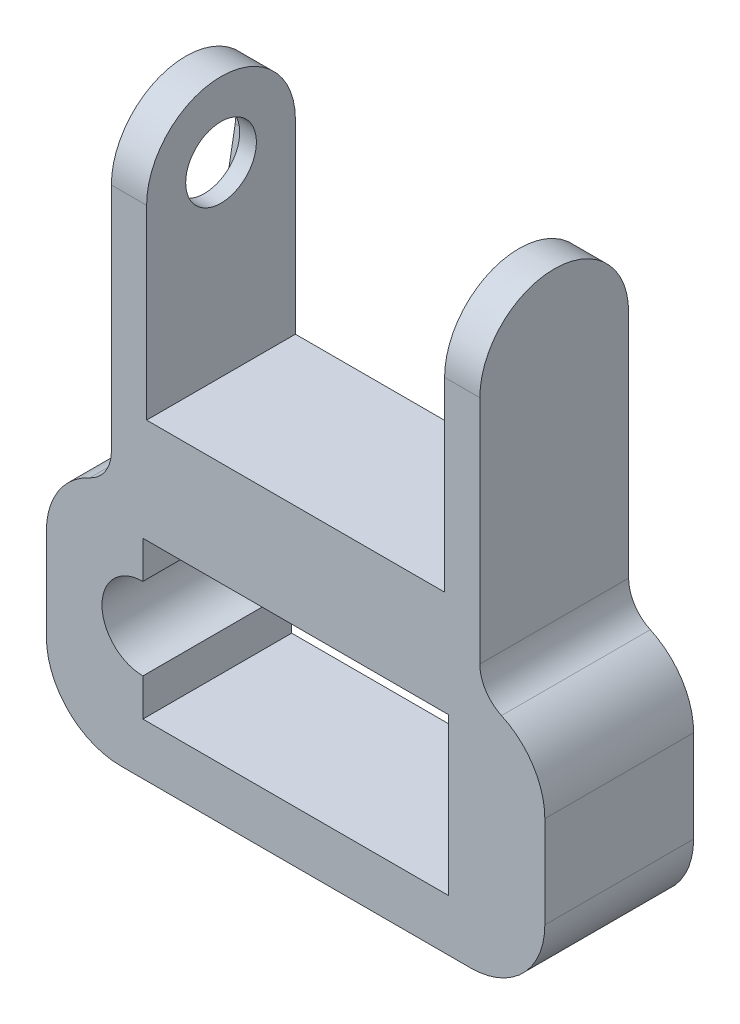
ISO-10303-21;
HEADER;
FILE_DESCRIPTION(('STEP AP214'),'2;1');
FILE_NAME('part.step','',(''),(''),'','','');
FILE_SCHEMA(('AUTOMOTIVE_DESIGN { 1 0 10303 214 1 1 1 1 }'));
ENDSEC;
DATA;
#1=APPLICATION_CONTEXT('core data for automotive mechanical design processes');
#2=APPLICATION_PROTOCOL_DEFINITION('international standard','automotive_design',2000,#1);
#3=PRODUCT_CONTEXT('',#1,'mechanical');
#4=PRODUCT('Part','Part','',(#3));
#5=PRODUCT_RELATED_PRODUCT_CATEGORY('part','',(#4));
#6=PRODUCT_DEFINITION_FORMATION('','',#4);
#7=PRODUCT_DEFINITION_CONTEXT('part definition',#1,'design');
#8=PRODUCT_DEFINITION('design','',#6,#7);
#9=PRODUCT_DEFINITION_SHAPE('','',#8);
#10=(LENGTH_UNIT() NAMED_UNIT(*) SI_UNIT(.MILLI.,.METRE.));
#11=(NAMED_UNIT(*) PLANE_ANGLE_UNIT() SI_UNIT($,.RADIAN.));
#12=(NAMED_UNIT(*) SI_UNIT($,.STERADIAN.) SOLID_ANGLE_UNIT());
#13=UNCERTAINTY_MEASURE_WITH_UNIT(LENGTH_MEASURE(1.E-05),#10,'distance_accuracy_value','');
#14=(GEOMETRIC_REPRESENTATION_CONTEXT(3) GLOBAL_UNCERTAINTY_ASSIGNED_CONTEXT((#13)) GLOBAL_UNIT_ASSIGNED_CONTEXT((#10,
#11,#12)) REPRESENTATION_CONTEXT('',''));
#15=CARTESIAN_POINT('',(0.,0.,0.));
#16=DIRECTION('',(0.,0.,1.));
#17=DIRECTION('',(1.,0.,0.));
#18=AXIS2_PLACEMENT_3D('',#15,#16,#17);
#19=CARTESIAN_POINT('',(-19.5,32.5,10.));
#20=DIRECTION('',(-1.,0.,0.));
#21=DIRECTION('',(0.,0.,1.));
#22=AXIS2_PLACEMENT_3D('',#19,#20,#21);
#23=CYLINDRICAL_SURFACE('',#22,4.75);
#24=CARTESIAN_POINT('',(-20.025,32.5,10.));
#25=DIRECTION('',(-1.,0.,0.));
#26=DIRECTION('',(0.,0.,1.));
#27=AXIS2_PLACEMENT_3D('',#24,#25,#26);
#28=CIRCLE('',#27,4.75);
#29=CARTESIAN_POINT('',(-20.025,32.5,14.75));
#30=VERTEX_POINT('',#29);
#31=EDGE_CURVE('E261',#30,#30,#28,.T.);
#32=ORIENTED_EDGE('',*,*,#31,.F.);
#33=EDGE_LOOP('',(#32));
#34=FACE_BOUND('',#33,.T.);
#35=CARTESIAN_POINT('',(-22.2625,32.5,10.));
#36=DIRECTION('',(-1.,0.,0.));
#37=DIRECTION('',(0.,-1.,0.));
#38=AXIS2_PLACEMENT_3D('',#35,#36,#37);
#39=CIRCLE('',#38,4.75);
#40=CARTESIAN_POINT('',(-22.2625,27.75,10.));
#41=VERTEX_POINT('',#40);
#42=EDGE_CURVE('E252',#41,#41,#39,.F.);
#43=ORIENTED_EDGE('',*,*,#42,.F.);
#44=EDGE_LOOP('',(#43));
#45=FACE_BOUND('',#44,.T.);
#46=ADVANCED_FACE('F36',(#34,#45),#23,.F.);
#47=CARTESIAN_POINT('',(0.,0.,20.));
#48=DIRECTION('',(0.,0.,-1.));
#49=DIRECTION('',(-1.,0.,0.));
#50=AXIS2_PLACEMENT_3D('',#47,#48,#49);
#51=PLANE('',#50);
#52=DIRECTION('',(1.,0.,0.));
#53=VECTOR('',#52,1.);
#54=CARTESIAN_POINT('',(-20.525,-27.55,20.));
#55=LINE('',#54,#53);
#56=CARTESIAN_POINT('',(-20.525,-27.55,20.));
#57=VERTEX_POINT('',#56);
#58=CARTESIAN_POINT('',(20.525,-27.55,20.));
#59=VERTEX_POINT('',#58);
#60=EDGE_CURVE('E313',#57,#59,#55,.T.);
#61=ORIENTED_EDGE('',*,*,#60,.F.);
#62=DIRECTION('',(0.,-1.,0.));
#63=VECTOR('',#62,1.);
#64=CARTESIAN_POINT('',(-20.525,-27.55,20.));
#65=LINE('',#64,#63);
#66=CARTESIAN_POINT('',(-20.525,-22.525,20.));
#67=VERTEX_POINT('',#66);
#68=EDGE_CURVE('E291',#67,#57,#65,.T.);
#69=ORIENTED_EDGE('',*,*,#68,.F.);
#70=CARTESIAN_POINT('',(-20.525,-17.025,20.));
#71=DIRECTION('',(0.,0.,1.));
#72=DIRECTION('',(1.,0.,0.));
#73=AXIS2_PLACEMENT_3D('',#70,#71,#72);
#74=CIRCLE('',#73,5.5);
#75=CARTESIAN_POINT('',(-20.525,-11.525,20.));
#76=VERTEX_POINT('',#75);
#77=EDGE_CURVE('E296',#76,#67,#74,.T.);
#78=ORIENTED_EDGE('',*,*,#77,.F.);
#79=DIRECTION('',(0.,-1.,0.));
#80=VECTOR('',#79,1.);
#81=CARTESIAN_POINT('',(-20.525,-11.525,20.));
#82=LINE('',#81,#80);
#83=CARTESIAN_POINT('',(-20.525,-6.50000000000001,20.));
#84=VERTEX_POINT('',#83);
#85=EDGE_CURVE('E322',#84,#76,#82,.T.);
#86=ORIENTED_EDGE('',*,*,#85,.F.);
#87=DIRECTION('',(-1.,0.,0.));
#88=VECTOR('',#87,1.);
#89=CARTESIAN_POINT('',(-20.525,-6.50000000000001,20.));
#90=LINE('',#89,#88);
#91=CARTESIAN_POINT('',(20.525,-6.50000000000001,20.));
#92=VERTEX_POINT('',#91);
#93=EDGE_CURVE('E319',#92,#84,#90,.T.);
#94=ORIENTED_EDGE('',*,*,#93,.F.);
#95=DIRECTION('',(0.,1.,0.));
#96=VECTOR('',#95,1.);
#97=CARTESIAN_POINT('',(20.525,-27.55,20.));
#98=LINE('',#97,#96);
#99=EDGE_CURVE('E316',#59,#92,#98,.T.);
#100=ORIENTED_EDGE('',*,*,#99,.F.);
#101=EDGE_LOOP('',(#61,#69,#78,#86,#94,#100));
#102=FACE_BOUND('',#101,.T.);
#103=DIRECTION('',(-1.,0.,0.));
#104=VECTOR('',#103,1.);
#105=CARTESIAN_POINT('',(-37.5,-34.5,20.));
#106=LINE('',#105,#104);
#107=CARTESIAN_POINT('',(23.5,-34.5,20.));
#108=VERTEX_POINT('',#107);
#109=CARTESIAN_POINT('',(-23.5,-34.5,20.));
#110=VERTEX_POINT('',#109);
#111=EDGE_CURVE('E277',#108,#110,#106,.T.);
#112=ORIENTED_EDGE('',*,*,#111,.F.);
#113=CARTESIAN_POINT('',(23.5,-24.5,20.));
#114=DIRECTION('',(0.,0.,-1.));
#115=DIRECTION('',(-1.,0.,0.));
#116=AXIS2_PLACEMENT_3D('',#113,#114,#115);
#117=CIRCLE('',#116,10.);
#118=CARTESIAN_POINT('',(33.5,-24.5,20.));
#119=VERTEX_POINT('',#118);
#120=EDGE_CURVE('E413',#108,#119,#117,.F.);
#121=ORIENTED_EDGE('',*,*,#120,.T.);
#122=DIRECTION('',(0.,-1.,0.));
#123=VECTOR('',#122,1.);
#124=CARTESIAN_POINT('',(33.5,-3.49999999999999,20.));
#125=LINE('',#124,#123);
#126=CARTESIAN_POINT('',(33.5,-12.1301538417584,20.));
#127=VERTEX_POINT('',#126);
#128=EDGE_CURVE('E269',#127,#119,#125,.T.);
#129=ORIENTED_EDGE('',*,*,#128,.F.);
#130=CARTESIAN_POINT('',(23.5,-12.1301538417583,20.));
#131=DIRECTION('',(0.,0.,-1.));
#132=DIRECTION('',(-1.,0.,0.));
#133=AXIS2_PLACEMENT_3D('',#130,#131,#132);
#134=CIRCLE('',#133,10.);
#135=CARTESIAN_POINT('',(27.675,-3.04338461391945,20.));
#136=VERTEX_POINT('',#135);
#137=EDGE_CURVE('E392',#127,#136,#134,.F.);
#138=ORIENTED_EDGE('',*,*,#137,.T.);
#139=CARTESIAN_POINT('',(29.7625,1.5,20.));
#140=DIRECTION('',(0.,0.,-1.));
#141=DIRECTION('',(-1.,0.,0.));
#142=AXIS2_PLACEMENT_3D('',#139,#140,#141);
#143=CIRCLE('',#142,5.);
#144=CARTESIAN_POINT('',(24.7625,1.5,20.));
#145=VERTEX_POINT('',#144);
#146=EDGE_CURVE('E376',#136,#145,#143,.T.);
#147=ORIENTED_EDGE('',*,*,#146,.T.);
#148=DIRECTION('',(0.,-1.,0.));
#149=VECTOR('',#148,1.);
#150=CARTESIAN_POINT('',(24.7625,42.5,20.));
#151=LINE('',#150,#149);
#152=CARTESIAN_POINT('',(24.7625,32.5,20.));
#153=VERTEX_POINT('',#152);
#154=EDGE_CURVE('E271',#153,#145,#151,.T.);
#155=ORIENTED_EDGE('',*,*,#154,.F.);
#156=DIRECTION('',(-1.,0.,0.));
#157=VECTOR('',#156,1.);
#158=CARTESIAN_POINT('',(37.5,32.5,20.));
#159=LINE('',#158,#157);
#160=CARTESIAN_POINT('',(20.025,32.5,20.));
#161=VERTEX_POINT('',#160);
#162=EDGE_CURVE('E283',#153,#161,#159,.T.);
#163=ORIENTED_EDGE('',*,*,#162,.T.);
#164=DIRECTION('',(0.,1.,0.));
#165=VECTOR('',#164,1.);
#166=CARTESIAN_POINT('',(20.025,42.5,20.));
#167=LINE('',#166,#165);
#168=CARTESIAN_POINT('',(20.025,7.49999999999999,20.));
#169=VERTEX_POINT('',#168);
#170=EDGE_CURVE('E343',#169,#161,#167,.T.);
#171=ORIENTED_EDGE('',*,*,#170,.F.);
#172=DIRECTION('',(1.,0.,0.));
#173=VECTOR('',#172,1.);
#174=CARTESIAN_POINT('',(-20.025,7.49999999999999,20.));
#175=LINE('',#174,#173);
#176=CARTESIAN_POINT('',(-20.025,7.49999999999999,20.));
#177=VERTEX_POINT('',#176);
#178=EDGE_CURVE('E351',#177,#169,#175,.T.);
#179=ORIENTED_EDGE('',*,*,#178,.F.);
#180=DIRECTION('',(0.,-1.,0.));
#181=VECTOR('',#180,1.);
#182=CARTESIAN_POINT('',(-20.025,42.5,20.));
#183=LINE('',#182,#181);
#184=CARTESIAN_POINT('',(-20.025,32.5,20.));
#185=VERTEX_POINT('',#184);
#186=EDGE_CURVE('E329',#185,#177,#183,.T.);
#187=ORIENTED_EDGE('',*,*,#186,.F.);
#188=CARTESIAN_POINT('',(-24.7625,32.5,20.));
#189=VERTEX_POINT('',#188);
#190=EDGE_CURVE('E286',#185,#189,#159,.T.);
#191=ORIENTED_EDGE('',*,*,#190,.T.);
#192=DIRECTION('',(0.,1.,0.));
#193=VECTOR('',#192,1.);
#194=CARTESIAN_POINT('',(-24.7625,42.5,20.));
#195=LINE('',#194,#193);
#196=CARTESIAN_POINT('',(-24.7625,1.49999999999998,20.));
#197=VERTEX_POINT('',#196);
#198=EDGE_CURVE('E259',#197,#189,#195,.T.);
#199=ORIENTED_EDGE('',*,*,#198,.F.);
#200=CARTESIAN_POINT('',(-29.7625,1.49999999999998,20.));
#201=DIRECTION('',(0.,0.,-1.));
#202=DIRECTION('',(-1.,0.,0.));
#203=AXIS2_PLACEMENT_3D('',#200,#201,#202);
#204=CIRCLE('',#203,5.);
#205=CARTESIAN_POINT('',(-27.675,-3.04338461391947,20.));
#206=VERTEX_POINT('',#205);
#207=EDGE_CURVE('E381',#197,#206,#204,.T.);
#208=ORIENTED_EDGE('',*,*,#207,.T.);
#209=CARTESIAN_POINT('',(-23.5,-12.1301538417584,20.));
#210=DIRECTION('',(0.,0.,-1.));
#211=DIRECTION('',(-1.,0.,0.));
#212=AXIS2_PLACEMENT_3D('',#209,#210,#211);
#213=CIRCLE('',#212,10.);
#214=CARTESIAN_POINT('',(-33.5,-12.1301538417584,20.));
#215=VERTEX_POINT('',#214);
#216=EDGE_CURVE('E389',#206,#215,#213,.F.);
#217=ORIENTED_EDGE('',*,*,#216,.T.);
#218=DIRECTION('',(0.,1.,0.));
#219=VECTOR('',#218,1.);
#220=CARTESIAN_POINT('',(-33.5,-3.50000000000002,20.));
#221=LINE('',#220,#219);
#222=CARTESIAN_POINT('',(-33.5,-24.5,20.));
#223=VERTEX_POINT('',#222);
#224=EDGE_CURVE('E262',#223,#215,#221,.T.);
#225=ORIENTED_EDGE('',*,*,#224,.F.);
#226=CARTESIAN_POINT('',(-23.5,-24.5,20.));
#227=DIRECTION('',(0.,0.,-1.));
#228=DIRECTION('',(-1.,0.,0.));
#229=AXIS2_PLACEMENT_3D('',#226,#227,#228);
#230=CIRCLE('',#229,10.);
#231=EDGE_CURVE('E411',#223,#110,#230,.F.);
#232=ORIENTED_EDGE('',*,*,#231,.T.);
#233=EDGE_LOOP('',(#112,#121,#129,#138,#147,#155,#163,#171,#179,#187,#191,#199,#208,#217,#225,#232));
#234=FACE_BOUND('',#233,.T.);
#235=ADVANCED_FACE('F429',(#102,#234),#51,.F.);
#236=CARTESIAN_POINT('',(-20.025,42.5,0.));
#237=DIRECTION('',(-1.,0.,0.));
#238=DIRECTION('',(0.,0.,1.));
#239=AXIS2_PLACEMENT_3D('',#236,#237,#238);
#240=PLANE('',#239);
#241=ORIENTED_EDGE('',*,*,#31,.T.);
#242=EDGE_LOOP('',(#241));
#243=FACE_BOUND('',#242,.T.);
#244=DIRECTION('',(0.,-1.,0.));
#245=VECTOR('',#244,1.);
#246=CARTESIAN_POINT('',(-20.025,42.5,0.));
#247=LINE('',#246,#245);
#248=CARTESIAN_POINT('',(-20.025,32.5,0.));
#249=VERTEX_POINT('',#248);
#250=CARTESIAN_POINT('',(-20.025,7.49999999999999,0.));
#251=VERTEX_POINT('',#250);
#252=EDGE_CURVE('E340',#249,#251,#247,.T.);
#253=ORIENTED_EDGE('',*,*,#252,.F.);
#254=CARTESIAN_POINT('',(-20.025,32.5,10.));
#255=DIRECTION('',(-1.,0.,0.));
#256=DIRECTION('',(0.,0.,1.));
#257=AXIS2_PLACEMENT_3D('',#254,#255,#256);
#258=CIRCLE('',#257,9.99999999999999);
#259=EDGE_CURVE('E285',#249,#185,#258,.F.);
#260=ORIENTED_EDGE('',*,*,#259,.T.);
#261=ORIENTED_EDGE('',*,*,#186,.T.);
#262=DIRECTION('',(0.,0.,1.));
#263=VECTOR('',#262,1.);
#264=CARTESIAN_POINT('',(-20.025,7.49999999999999,0.));
#265=LINE('',#264,#263);
#266=EDGE_CURVE('E349',#251,#177,#265,.T.);
#267=ORIENTED_EDGE('',*,*,#266,.F.);
#268=EDGE_LOOP('',(#253,#260,#261,#267));
#269=FACE_BOUND('',#268,.T.);
#270=ADVANCED_FACE('F462',(#243,#269),#240,.F.);
#271=CARTESIAN_POINT('',(20.025,42.5,0.));
#272=DIRECTION('',(1.,0.,0.));
#273=DIRECTION('',(0.,0.,-1.));
#274=AXIS2_PLACEMENT_3D('',#271,#272,#273);
#275=PLANE('',#274);
#276=ORIENTED_EDGE('',*,*,#170,.T.);
#277=CARTESIAN_POINT('',(20.025,32.5,10.));
#278=DIRECTION('',(1.,0.,0.));
#279=DIRECTION('',(0.,0.,-1.));
#280=AXIS2_PLACEMENT_3D('',#277,#278,#279);
#281=CIRCLE('',#280,9.99999999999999);
#282=CARTESIAN_POINT('',(20.025,32.5,0.));
#283=VERTEX_POINT('',#282);
#284=EDGE_CURVE('E358',#161,#283,#281,.F.);
#285=ORIENTED_EDGE('',*,*,#284,.T.);
#286=DIRECTION('',(0.,1.,0.));
#287=VECTOR('',#286,1.);
#288=CARTESIAN_POINT('',(20.025,42.5,0.));
#289=LINE('',#288,#287);
#290=CARTESIAN_POINT('',(20.025,7.49999999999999,0.));
#291=VERTEX_POINT('',#290);
#292=EDGE_CURVE('E346',#291,#283,#289,.T.);
#293=ORIENTED_EDGE('',*,*,#292,.F.);
#294=DIRECTION('',(0.,0.,1.));
#295=VECTOR('',#294,1.);
#296=CARTESIAN_POINT('',(20.025,7.49999999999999,0.));
#297=LINE('',#296,#295);
#298=EDGE_CURVE('E356',#291,#169,#297,.T.);
#299=ORIENTED_EDGE('',*,*,#298,.T.);
#300=EDGE_LOOP('',(#276,#285,#293,#299));
#301=FACE_BOUND('',#300,.T.);
#302=ADVANCED_FACE('F450',(#301),#275,.F.);
#303=CARTESIAN_POINT('',(0.,0.,0.));
#304=DIRECTION('',(0.,0.,-1.));
#305=DIRECTION('',(-1.,0.,0.));
#306=AXIS2_PLACEMENT_3D('',#303,#304,#305);
#307=PLANE('',#306);
#308=DIRECTION('',(0.,-1.,0.));
#309=VECTOR('',#308,1.);
#310=CARTESIAN_POINT('',(33.5,-3.49999999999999,0.));
#311=LINE('',#310,#309);
#312=CARTESIAN_POINT('',(33.5,-12.1301538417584,0.));
#313=VERTEX_POINT('',#312);
#314=CARTESIAN_POINT('',(33.5,-24.5,0.));
#315=VERTEX_POINT('',#314);
#316=EDGE_CURVE('E264',#313,#315,#311,.T.);
#317=ORIENTED_EDGE('',*,*,#316,.T.);
#318=CARTESIAN_POINT('',(23.5,-24.5,0.));
#319=DIRECTION('',(0.,0.,-1.));
#320=DIRECTION('',(-1.,0.,0.));
#321=AXIS2_PLACEMENT_3D('',#318,#319,#320);
#322=CIRCLE('',#321,10.);
#323=CARTESIAN_POINT('',(23.5,-34.5,0.));
#324=VERTEX_POINT('',#323);
#325=EDGE_CURVE('E44',#315,#324,#322,.T.);
#326=ORIENTED_EDGE('',*,*,#325,.T.);
#327=DIRECTION('',(-1.,0.,0.));
#328=VECTOR('',#327,1.);
#329=CARTESIAN_POINT('',(-37.5,-34.5,0.));
#330=LINE('',#329,#328);
#331=CARTESIAN_POINT('',(-23.5,-34.5,0.));
#332=VERTEX_POINT('',#331);
#333=EDGE_CURVE('E278',#324,#332,#330,.T.);
#334=ORIENTED_EDGE('',*,*,#333,.T.);
#335=CARTESIAN_POINT('',(-23.5,-24.5,0.));
#336=DIRECTION('',(0.,0.,-1.));
#337=DIRECTION('',(-1.,0.,0.));
#338=AXIS2_PLACEMENT_3D('',#335,#336,#337);
#339=CIRCLE('',#338,10.);
#340=CARTESIAN_POINT('',(-33.5,-24.5,0.));
#341=VERTEX_POINT('',#340);
#342=EDGE_CURVE('E51',#332,#341,#339,.T.);
#343=ORIENTED_EDGE('',*,*,#342,.T.);
#344=DIRECTION('',(0.,1.,0.));
#345=VECTOR('',#344,1.);
#346=CARTESIAN_POINT('',(-33.5,-3.50000000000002,0.));
#347=LINE('',#346,#345);
#348=CARTESIAN_POINT('',(-33.5,-12.1301538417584,0.));
#349=VERTEX_POINT('',#348);
#350=EDGE_CURVE('E256',#341,#349,#347,.T.);
#351=ORIENTED_EDGE('',*,*,#350,.T.);
#352=CARTESIAN_POINT('',(-23.5,-12.1301538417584,0.));
#353=DIRECTION('',(0.,0.,-1.));
#354=DIRECTION('',(-1.,0.,0.));
#355=AXIS2_PLACEMENT_3D('',#352,#353,#354);
#356=CIRCLE('',#355,10.);
#357=CARTESIAN_POINT('',(-27.675,-3.04338461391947,0.));
#358=VERTEX_POINT('',#357);
#359=EDGE_CURVE('E396',#349,#358,#356,.T.);
#360=ORIENTED_EDGE('',*,*,#359,.T.);
#361=CARTESIAN_POINT('',(-29.7625,1.49999999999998,0.));
#362=DIRECTION('',(0.,0.,-1.));
#363=DIRECTION('',(-1.,0.,0.));
#364=AXIS2_PLACEMENT_3D('',#361,#362,#363);
#365=CIRCLE('',#364,5.);
#366=CARTESIAN_POINT('',(-24.7625,1.49999999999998,0.));
#367=VERTEX_POINT('',#366);
#368=EDGE_CURVE('E384',#358,#367,#365,.F.);
#369=ORIENTED_EDGE('',*,*,#368,.T.);
#370=DIRECTION('',(0.,1.,0.));
#371=VECTOR('',#370,1.);
#372=CARTESIAN_POINT('',(-24.7625,42.5,0.));
#373=LINE('',#372,#371);
#374=CARTESIAN_POINT('',(-24.7625,32.5,0.));
#375=VERTEX_POINT('',#374);
#376=EDGE_CURVE('E258',#367,#375,#373,.T.);
#377=ORIENTED_EDGE('',*,*,#376,.T.);
#378=DIRECTION('',(-1.,0.,0.));
#379=VECTOR('',#378,1.);
#380=CARTESIAN_POINT('',(37.5,32.5,0.));
#381=LINE('',#380,#379);
#382=EDGE_CURVE('E280',#249,#375,#381,.T.);
#383=ORIENTED_EDGE('',*,*,#382,.F.);
#384=ORIENTED_EDGE('',*,*,#252,.T.);
#385=DIRECTION('',(1.,0.,0.));
#386=VECTOR('',#385,1.);
#387=CARTESIAN_POINT('',(-20.025,7.49999999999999,0.));
#388=LINE('',#387,#386);
#389=EDGE_CURVE('E342',#251,#291,#388,.T.);
#390=ORIENTED_EDGE('',*,*,#389,.T.);
#391=ORIENTED_EDGE('',*,*,#292,.T.);
#392=CARTESIAN_POINT('',(24.7625,32.5,0.));
#393=VERTEX_POINT('',#392);
#394=EDGE_CURVE('E287',#393,#283,#381,.T.);
#395=ORIENTED_EDGE('',*,*,#394,.F.);
#396=DIRECTION('',(0.,-1.,0.));
#397=VECTOR('',#396,1.);
#398=CARTESIAN_POINT('',(24.7625,42.5,0.));
#399=LINE('',#398,#397);
#400=CARTESIAN_POINT('',(24.7625,1.5,0.));
#401=VERTEX_POINT('',#400);
#402=EDGE_CURVE('E266',#393,#401,#399,.T.);
#403=ORIENTED_EDGE('',*,*,#402,.T.);
#404=CARTESIAN_POINT('',(29.7625,1.5,0.));
#405=DIRECTION('',(0.,0.,-1.));
#406=DIRECTION('',(-1.,0.,0.));
#407=AXIS2_PLACEMENT_3D('',#404,#405,#406);
#408=CIRCLE('',#407,5.);
#409=CARTESIAN_POINT('',(27.675,-3.04338461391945,0.));
#410=VERTEX_POINT('',#409);
#411=EDGE_CURVE('E378',#401,#410,#408,.F.);
#412=ORIENTED_EDGE('',*,*,#411,.T.);
#413=CARTESIAN_POINT('',(23.5,-12.1301538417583,0.));
#414=DIRECTION('',(0.,0.,-1.));
#415=DIRECTION('',(-1.,0.,0.));
#416=AXIS2_PLACEMENT_3D('',#413,#414,#415);
#417=CIRCLE('',#416,10.);
#418=EDGE_CURVE('E398',#410,#313,#417,.T.);
#419=ORIENTED_EDGE('',*,*,#418,.T.);
#420=EDGE_LOOP('',(#317,#326,#334,#343,#351,#360,#369,#377,#383,#384,#390,#391,#395,#403,#412,#419));
#421=FACE_BOUND('',#420,.T.);
#422=DIRECTION('',(0.,-1.,0.));
#423=VECTOR('',#422,1.);
#424=CARTESIAN_POINT('',(-20.525,-27.55,0.));
#425=LINE('',#424,#423);
#426=CARTESIAN_POINT('',(-20.525,-22.525,0.));
#427=VERTEX_POINT('',#426);
#428=CARTESIAN_POINT('',(-20.525,-27.55,0.));
#429=VERTEX_POINT('',#428);
#430=EDGE_CURVE('E292',#427,#429,#425,.T.);
#431=ORIENTED_EDGE('',*,*,#430,.T.);
#432=DIRECTION('',(1.,0.,0.));
#433=VECTOR('',#432,1.);
#434=CARTESIAN_POINT('',(-20.525,-27.55,0.));
#435=LINE('',#434,#433);
#436=CARTESIAN_POINT('',(20.525,-27.55,0.));
#437=VERTEX_POINT('',#436);
#438=EDGE_CURVE('E295',#429,#437,#435,.T.);
#439=ORIENTED_EDGE('',*,*,#438,.T.);
#440=DIRECTION('',(0.,1.,0.));
#441=VECTOR('',#440,1.);
#442=CARTESIAN_POINT('',(20.525,-27.55,0.));
#443=LINE('',#442,#441);
#444=CARTESIAN_POINT('',(20.525,-6.50000000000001,0.));
#445=VERTEX_POINT('',#444);
#446=EDGE_CURVE('E299',#437,#445,#443,.T.);
#447=ORIENTED_EDGE('',*,*,#446,.T.);
#448=DIRECTION('',(-1.,0.,0.));
#449=VECTOR('',#448,1.);
#450=CARTESIAN_POINT('',(-20.525,-6.50000000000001,0.));
#451=LINE('',#450,#449);
#452=CARTESIAN_POINT('',(-20.525,-6.50000000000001,0.));
#453=VERTEX_POINT('',#452);
#454=EDGE_CURVE('E302',#445,#453,#451,.T.);
#455=ORIENTED_EDGE('',*,*,#454,.T.);
#456=DIRECTION('',(0.,-1.,0.));
#457=VECTOR('',#456,1.);
#458=CARTESIAN_POINT('',(-20.525,-11.525,0.));
#459=LINE('',#458,#457);
#460=CARTESIAN_POINT('',(-20.525,-11.525,0.));
#461=VERTEX_POINT('',#460);
#462=EDGE_CURVE('E305',#453,#461,#459,.T.);
#463=ORIENTED_EDGE('',*,*,#462,.T.);
#464=CARTESIAN_POINT('',(-20.525,-17.025,0.));
#465=DIRECTION('',(0.,0.,1.));
#466=DIRECTION('',(1.,0.,0.));
#467=AXIS2_PLACEMENT_3D('',#464,#465,#466);
#468=CIRCLE('',#467,5.5);
#469=EDGE_CURVE('E308',#461,#427,#468,.T.);
#470=ORIENTED_EDGE('',*,*,#469,.T.);
#471=EDGE_LOOP('',(#431,#439,#447,#455,#463,#470));
#472=FACE_BOUND('',#471,.T.);
#473=ADVANCED_FACE('F418',(#421,#472),#307,.T.);
#474=CARTESIAN_POINT('',(-20.025,7.49999999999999,0.));
#475=DIRECTION('',(0.,-1.,0.));
#476=DIRECTION('',(0.,0.,-1.));
#477=AXIS2_PLACEMENT_3D('',#474,#475,#476);
#478=PLANE('',#477);
#479=ORIENTED_EDGE('',*,*,#178,.T.);
#480=ORIENTED_EDGE('',*,*,#298,.F.);
#481=ORIENTED_EDGE('',*,*,#389,.F.);
#482=ORIENTED_EDGE('',*,*,#266,.T.);
#483=EDGE_LOOP('',(#479,#480,#481,#482));
#484=FACE_BOUND('',#483,.T.);
#485=ADVANCED_FACE('F457',(#484),#478,.F.);
#486=CARTESIAN_POINT('',(-20.525,-27.55,0.));
#487=DIRECTION('',(-1.,0.,0.));
#488=DIRECTION('',(0.,0.,1.));
#489=AXIS2_PLACEMENT_3D('',#486,#487,#488);
#490=PLANE('',#489);
#491=ORIENTED_EDGE('',*,*,#68,.T.);
#492=DIRECTION('',(0.,0.,1.));
#493=VECTOR('',#492,1.);
#494=CARTESIAN_POINT('',(-20.525,-27.55,0.));
#495=LINE('',#494,#493);
#496=EDGE_CURVE('E311',#429,#57,#495,.T.);
#497=ORIENTED_EDGE('',*,*,#496,.F.);
#498=ORIENTED_EDGE('',*,*,#430,.F.);
#499=DIRECTION('',(0.,0.,1.));
#500=VECTOR('',#499,1.);
#501=CARTESIAN_POINT('',(-20.525,-22.525,0.));
#502=LINE('',#501,#500);
#503=EDGE_CURVE('E327',#427,#67,#502,.T.);
#504=ORIENTED_EDGE('',*,*,#503,.T.);
#505=EDGE_LOOP('',(#491,#497,#498,#504));
#506=FACE_BOUND('',#505,.T.);
#507=ADVANCED_FACE('F511',(#506),#490,.F.);
#508=CARTESIAN_POINT('',(-20.525,-17.025,0.));
#509=DIRECTION('',(0.,0.,1.));
#510=DIRECTION('',(1.,0.,0.));
#511=AXIS2_PLACEMENT_3D('',#508,#509,#510);
#512=CYLINDRICAL_SURFACE('',#511,5.5);
#513=ORIENTED_EDGE('',*,*,#77,.T.);
#514=ORIENTED_EDGE('',*,*,#503,.F.);
#515=ORIENTED_EDGE('',*,*,#469,.F.);
#516=DIRECTION('',(0.,0.,1.));
#517=VECTOR('',#516,1.);
#518=CARTESIAN_POINT('',(-20.525,-11.525,0.));
#519=LINE('',#518,#517);
#520=EDGE_CURVE('E330',#461,#76,#519,.T.);
#521=ORIENTED_EDGE('',*,*,#520,.T.);
#522=EDGE_LOOP('',(#513,#514,#515,#521));
#523=FACE_BOUND('',#522,.T.);
#524=ADVANCED_FACE('F507',(#523),#512,.F.);
#525=CARTESIAN_POINT('',(-20.525,-11.525,0.));
#526=DIRECTION('',(-1.,0.,0.));
#527=DIRECTION('',(0.,0.,1.));
#528=AXIS2_PLACEMENT_3D('',#525,#526,#527);
#529=PLANE('',#528);
#530=ORIENTED_EDGE('',*,*,#85,.T.);
#531=ORIENTED_EDGE('',*,*,#520,.F.);
#532=ORIENTED_EDGE('',*,*,#462,.F.);
#533=DIRECTION('',(0.,0.,1.));
#534=VECTOR('',#533,1.);
#535=CARTESIAN_POINT('',(-20.525,-6.50000000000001,0.));
#536=LINE('',#535,#534);
#537=EDGE_CURVE('E332',#453,#84,#536,.T.);
#538=ORIENTED_EDGE('',*,*,#537,.T.);
#539=EDGE_LOOP('',(#530,#531,#532,#538));
#540=FACE_BOUND('',#539,.T.);
#541=ADVANCED_FACE('F510',(#540),#529,.F.);
#542=CARTESIAN_POINT('',(-20.525,-6.50000000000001,0.));
#543=DIRECTION('',(0.,1.,0.));
#544=DIRECTION('',(0.,0.,1.));
#545=AXIS2_PLACEMENT_3D('',#542,#543,#544);
#546=PLANE('',#545);
#547=ORIENTED_EDGE('',*,*,#93,.T.);
#548=ORIENTED_EDGE('',*,*,#537,.F.);
#549=ORIENTED_EDGE('',*,*,#454,.F.);
#550=DIRECTION('',(0.,0.,1.));
#551=VECTOR('',#550,1.);
#552=CARTESIAN_POINT('',(20.525,-6.50000000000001,0.));
#553=LINE('',#552,#551);
#554=EDGE_CURVE('E334',#445,#92,#553,.T.);
#555=ORIENTED_EDGE('',*,*,#554,.T.);
#556=EDGE_LOOP('',(#547,#548,#549,#555));
#557=FACE_BOUND('',#556,.T.);
#558=ADVANCED_FACE('F515',(#557),#546,.F.);
#559=CARTESIAN_POINT('',(20.525,-27.55,0.));
#560=DIRECTION('',(1.,0.,0.));
#561=DIRECTION('',(0.,0.,-1.));
#562=AXIS2_PLACEMENT_3D('',#559,#560,#561);
#563=PLANE('',#562);
#564=ORIENTED_EDGE('',*,*,#99,.T.);
#565=ORIENTED_EDGE('',*,*,#554,.F.);
#566=ORIENTED_EDGE('',*,*,#446,.F.);
#567=DIRECTION('',(0.,0.,1.));
#568=VECTOR('',#567,1.);
#569=CARTESIAN_POINT('',(20.525,-27.55,0.));
#570=LINE('',#569,#568);
#571=EDGE_CURVE('E336',#437,#59,#570,.T.);
#572=ORIENTED_EDGE('',*,*,#571,.T.);
#573=EDGE_LOOP('',(#564,#565,#566,#572));
#574=FACE_BOUND('',#573,.T.);
#575=ADVANCED_FACE('F519',(#574),#563,.F.);
#576=CARTESIAN_POINT('',(-20.525,-27.55,0.));
#577=DIRECTION('',(0.,-1.,0.));
#578=DIRECTION('',(0.,0.,-1.));
#579=AXIS2_PLACEMENT_3D('',#576,#577,#578);
#580=PLANE('',#579);
#581=ORIENTED_EDGE('',*,*,#60,.T.);
#582=ORIENTED_EDGE('',*,*,#571,.F.);
#583=ORIENTED_EDGE('',*,*,#438,.F.);
#584=ORIENTED_EDGE('',*,*,#496,.T.);
#585=EDGE_LOOP('',(#581,#582,#583,#584));
#586=FACE_BOUND('',#585,.T.);
#587=ADVANCED_FACE('F523',(#586),#580,.F.);
#588=CARTESIAN_POINT('',(37.5,32.5,10.));
#589=DIRECTION('',(-1.,0.,0.));
#590=DIRECTION('',(0.,0.,1.));
#591=AXIS2_PLACEMENT_3D('',#588,#589,#590);
#592=CYLINDRICAL_SURFACE('',#591,9.99999999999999);
#593=ORIENTED_EDGE('',*,*,#162,.F.);
#594=CARTESIAN_POINT('',(24.7625,32.5,10.));
#595=DIRECTION('',(-1.,0.,0.));
#596=DIRECTION('',(0.,-1.,0.));
#597=AXIS2_PLACEMENT_3D('',#594,#595,#596);
#598=CIRCLE('',#597,9.99999999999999);
#599=EDGE_CURVE('E366',#153,#393,#598,.T.);
#600=ORIENTED_EDGE('',*,*,#599,.T.);
#601=ORIENTED_EDGE('',*,*,#394,.T.);
#602=ORIENTED_EDGE('',*,*,#284,.F.);
#603=EDGE_LOOP('',(#593,#600,#601,#602));
#604=FACE_BOUND('',#603,.T.);
#605=ADVANCED_FACE('F448',(#604),#592,.T.);
#606=CARTESIAN_POINT('',(-24.7625,32.5,10.));
#607=DIRECTION('',(1.,0.,0.));
#608=DIRECTION('',(0.,1.,0.));
#609=AXIS2_PLACEMENT_3D('',#606,#607,#608);
#610=CIRCLE('',#609,9.99999999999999);
#611=EDGE_CURVE('E363',#375,#189,#610,.T.);
#612=ORIENTED_EDGE('',*,*,#611,.T.);
#613=ORIENTED_EDGE('',*,*,#190,.F.);
#614=ORIENTED_EDGE('',*,*,#259,.F.);
#615=ORIENTED_EDGE('',*,*,#382,.T.);
#616=EDGE_LOOP('',(#612,#613,#614,#615));
#617=FACE_BOUND('',#616,.T.);
#618=ADVANCED_FACE('F466',(#617),#592,.T.);
#619=CARTESIAN_POINT('',(-37.5,-34.5,0.));
#620=DIRECTION('',(0.,1.,0.));
#621=DIRECTION('',(0.,0.,1.));
#622=AXIS2_PLACEMENT_3D('',#619,#620,#621);
#623=PLANE('',#622);
#624=ORIENTED_EDGE('',*,*,#333,.F.);
#625=DIRECTION('',(0.,0.,1.));
#626=VECTOR('',#625,1.);
#627=CARTESIAN_POINT('',(23.5,-34.5,0.));
#628=LINE('',#627,#626);
#629=EDGE_CURVE('E408',#324,#108,#628,.T.);
#630=ORIENTED_EDGE('',*,*,#629,.T.);
#631=ORIENTED_EDGE('',*,*,#111,.T.);
#632=DIRECTION('',(0.,0.,1.));
#633=VECTOR('',#632,1.);
#634=CARTESIAN_POINT('',(-23.5,-34.5,0.));
#635=LINE('',#634,#633);
#636=EDGE_CURVE('E406',#110,#332,#635,.F.);
#637=ORIENTED_EDGE('',*,*,#636,.T.);
#638=EDGE_LOOP('',(#624,#630,#631,#637));
#639=FACE_BOUND('',#638,.T.);
#640=ADVANCED_FACE('F423',(#639),#623,.F.);
#641=CARTESIAN_POINT('',(24.7625,42.5,0.));
#642=DIRECTION('',(-1.,0.,0.));
#643=DIRECTION('',(0.,-1.,0.));
#644=AXIS2_PLACEMENT_3D('',#641,#642,#643);
#645=PLANE('',#644);
#646=ORIENTED_EDGE('',*,*,#154,.T.);
#647=DIRECTION('',(0.,0.,1.));
#648=VECTOR('',#647,1.);
#649=CARTESIAN_POINT('',(24.7625,1.5,0.));
#650=LINE('',#649,#648);
#651=EDGE_CURVE('E369',#145,#401,#650,.F.);
#652=ORIENTED_EDGE('',*,*,#651,.T.);
#653=ORIENTED_EDGE('',*,*,#402,.F.);
#654=ORIENTED_EDGE('',*,*,#599,.F.);
#655=EDGE_LOOP('',(#646,#652,#653,#654));
#656=FACE_BOUND('',#655,.T.);
#657=ADVANCED_FACE('F443',(#656),#645,.F.);
#658=CARTESIAN_POINT('',(33.5,-3.49999999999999,0.));
#659=DIRECTION('',(-1.,0.,0.));
#660=DIRECTION('',(0.,-1.,0.));
#661=AXIS2_PLACEMENT_3D('',#658,#659,#660);
#662=PLANE('',#661);
#663=ORIENTED_EDGE('',*,*,#128,.T.);
#664=DIRECTION('',(0.,0.,1.));
#665=VECTOR('',#664,1.);
#666=CARTESIAN_POINT('',(33.5,-24.5,0.));
#667=LINE('',#666,#665);
#668=EDGE_CURVE('E59',#119,#315,#667,.F.);
#669=ORIENTED_EDGE('',*,*,#668,.T.);
#670=ORIENTED_EDGE('',*,*,#316,.F.);
#671=DIRECTION('',(0.,0.,-1.));
#672=VECTOR('',#671,1.);
#673=CARTESIAN_POINT('',(33.5,-12.1301538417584,0.));
#674=LINE('',#673,#672);
#675=EDGE_CURVE('E386',#313,#127,#674,.F.);
#676=ORIENTED_EDGE('',*,*,#675,.T.);
#677=EDGE_LOOP('',(#663,#669,#670,#676));
#678=FACE_BOUND('',#677,.T.);
#679=ADVANCED_FACE('F430',(#678),#662,.F.);
#680=CARTESIAN_POINT('',(-24.7625,42.5,0.));
#681=DIRECTION('',(1.,0.,0.));
#682=DIRECTION('',(0.,1.,0.));
#683=AXIS2_PLACEMENT_3D('',#680,#681,#682);
#684=PLANE('',#683);
#685=DIRECTION('',(0.,-0.984305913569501,0.176470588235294));
#686=VECTOR('',#685,1.);
#687=CARTESIAN_POINT('',(-24.7625,31.3088235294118,3.35593508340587));
#688=LINE('',#687,#686);
#689=CARTESIAN_POINT('',(-24.7625,31.3088235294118,3.35593508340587));
#690=VERTEX_POINT('',#689);
#691=CARTESIAN_POINT('',(-24.7625,14.8382352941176,6.30885282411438));
#692=VERTEX_POINT('',#691);
#693=EDGE_CURVE('E246',#690,#692,#688,.T.);
#694=ORIENTED_EDGE('',*,*,#693,.F.);
#695=CARTESIAN_POINT('',(-24.7625,32.5,10.));
#696=DIRECTION('',(-1.,0.,0.));
#697=DIRECTION('',(0.,-1.,0.));
#698=AXIS2_PLACEMENT_3D('',#695,#696,#697);
#699=CIRCLE('',#698,6.75);
#700=CARTESIAN_POINT('',(-24.7625,32.5,16.75));
#701=VERTEX_POINT('',#700);
#702=EDGE_CURVE('E219',#701,#690,#699,.T.);
#703=ORIENTED_EDGE('',*,*,#702,.F.);
#704=DIRECTION('',(0.,0.985332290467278,0.17064664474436));
#705=VECTOR('',#704,1.);
#706=CARTESIAN_POINT('',(-24.7625,32.5,16.75));
#707=LINE('',#706,#705);
#708=CARTESIAN_POINT('',(-24.7625,14.8600750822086,13.6949960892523));
#709=VERTEX_POINT('',#708);
#710=EDGE_CURVE('E237',#709,#701,#707,.T.);
#711=ORIENTED_EDGE('',*,*,#710,.F.);
#712=CARTESIAN_POINT('',(-24.7625,15.5,10.));
#713=DIRECTION('',(-1.,0.,0.));
#714=DIRECTION('',(0.,-1.,0.));
#715=AXIS2_PLACEMENT_3D('',#712,#713,#714);
#716=CIRCLE('',#715,3.75);
#717=EDGE_CURVE('E240',#692,#709,#716,.T.);
#718=ORIENTED_EDGE('',*,*,#717,.F.);
#719=EDGE_LOOP('',(#694,#703,#711,#718));
#720=FACE_BOUND('',#719,.T.);
#721=ORIENTED_EDGE('',*,*,#376,.F.);
#722=DIRECTION('',(0.,0.,1.));
#723=VECTOR('',#722,1.);
#724=CARTESIAN_POINT('',(-24.7625,1.49999999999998,20.));
#725=LINE('',#724,#723);
#726=EDGE_CURVE('E373',#367,#197,#725,.T.);
#727=ORIENTED_EDGE('',*,*,#726,.T.);
#728=ORIENTED_EDGE('',*,*,#198,.T.);
#729=ORIENTED_EDGE('',*,*,#611,.F.);
#730=EDGE_LOOP('',(#721,#727,#728,#729));
#731=FACE_BOUND('',#730,.T.);
#732=ADVANCED_FACE('F472',(#720,#731),#684,.F.);
#733=CARTESIAN_POINT('',(-33.5,-3.50000000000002,0.));
#734=DIRECTION('',(1.,0.,0.));
#735=DIRECTION('',(0.,1.,0.));
#736=AXIS2_PLACEMENT_3D('',#733,#734,#735);
#737=PLANE('',#736);
#738=ORIENTED_EDGE('',*,*,#350,.F.);
#739=DIRECTION('',(0.,0.,1.));
#740=VECTOR('',#739,1.);
#741=CARTESIAN_POINT('',(-33.5,-24.5,0.));
#742=LINE('',#741,#740);
#743=EDGE_CURVE('E11',#341,#223,#742,.T.);
#744=ORIENTED_EDGE('',*,*,#743,.T.);
#745=ORIENTED_EDGE('',*,*,#224,.T.);
#746=DIRECTION('',(0.,0.,-1.));
#747=VECTOR('',#746,1.);
#748=CARTESIAN_POINT('',(-33.5,-12.1301538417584,0.));
#749=LINE('',#748,#747);
#750=EDGE_CURVE('E403',#215,#349,#749,.T.);
#751=ORIENTED_EDGE('',*,*,#750,.T.);
#752=EDGE_LOOP('',(#738,#744,#745,#751));
#753=FACE_BOUND('',#752,.T.);
#754=ADVANCED_FACE('F483',(#753),#737,.F.);
#755=CARTESIAN_POINT('',(-22.2625,32.5,10.));
#756=DIRECTION('',(-1.,0.,0.));
#757=DIRECTION('',(0.,-1.,0.));
#758=AXIS2_PLACEMENT_3D('',#755,#756,#757);
#759=PLANE('',#758);
#760=CARTESIAN_POINT('',(-22.2625,32.5,10.));
#761=DIRECTION('',(-1.,0.,0.));
#762=DIRECTION('',(0.,-1.,0.));
#763=AXIS2_PLACEMENT_3D('',#760,#761,#762);
#764=CIRCLE('',#763,6.75);
#765=CARTESIAN_POINT('',(-22.2625,32.5,16.75));
#766=VERTEX_POINT('',#765);
#767=CARTESIAN_POINT('',(-22.2625,31.3088235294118,3.35593508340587));
#768=VERTEX_POINT('',#767);
#769=EDGE_CURVE('E216',#766,#768,#764,.T.);
#770=ORIENTED_EDGE('',*,*,#769,.T.);
#771=DIRECTION('',(0.,-0.984305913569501,0.176470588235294));
#772=VECTOR('',#771,1.);
#773=CARTESIAN_POINT('',(-22.2625,31.3088235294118,3.35593508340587));
#774=LINE('',#773,#772);
#775=CARTESIAN_POINT('',(-22.2625,14.8382352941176,6.30885282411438));
#776=VERTEX_POINT('',#775);
#777=EDGE_CURVE('E227',#768,#776,#774,.T.);
#778=ORIENTED_EDGE('',*,*,#777,.T.);
#779=CARTESIAN_POINT('',(-22.2625,15.5,10.));
#780=DIRECTION('',(-1.,0.,0.));
#781=DIRECTION('',(0.,-1.,0.));
#782=AXIS2_PLACEMENT_3D('',#779,#780,#781);
#783=CIRCLE('',#782,3.75);
#784=CARTESIAN_POINT('',(-22.2625,14.8600750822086,13.6949960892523));
#785=VERTEX_POINT('',#784);
#786=EDGE_CURVE('E232',#776,#785,#783,.T.);
#787=ORIENTED_EDGE('',*,*,#786,.T.);
#788=DIRECTION('',(0.,0.985332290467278,0.17064664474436));
#789=VECTOR('',#788,1.);
#790=CARTESIAN_POINT('',(-22.2625,32.5,16.75));
#791=LINE('',#790,#789);
#792=EDGE_CURVE('E224',#785,#766,#791,.T.);
#793=ORIENTED_EDGE('',*,*,#792,.T.);
#794=EDGE_LOOP('',(#770,#778,#787,#793));
#795=FACE_BOUND('',#794,.T.);
#796=ORIENTED_EDGE('',*,*,#42,.T.);
#797=EDGE_LOOP('',(#796));
#798=FACE_BOUND('',#797,.T.);
#799=ADVANCED_FACE('F234',(#795,#798),#759,.T.);
#800=CARTESIAN_POINT('',(-22.2625,32.5,10.));
#801=DIRECTION('',(-1.,0.,0.));
#802=DIRECTION('',(0.,-1.,0.));
#803=AXIS2_PLACEMENT_3D('',#800,#801,#802);
#804=CYLINDRICAL_SURFACE('',#803,6.75);
#805=ORIENTED_EDGE('',*,*,#702,.T.);
#806=DIRECTION('',(-1.,0.,0.));
#807=VECTOR('',#806,1.);
#808=CARTESIAN_POINT('',(-22.2625,31.3088235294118,3.35593508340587));
#809=LINE('',#808,#807);
#810=EDGE_CURVE('E212',#768,#690,#809,.T.);
#811=ORIENTED_EDGE('',*,*,#810,.F.);
#812=ORIENTED_EDGE('',*,*,#769,.F.);
#813=DIRECTION('',(-1.,0.,0.));
#814=VECTOR('',#813,1.);
#815=CARTESIAN_POINT('',(-22.2625,32.5,16.75));
#816=LINE('',#815,#814);
#817=EDGE_CURVE('E250',#766,#701,#816,.T.);
#818=ORIENTED_EDGE('',*,*,#817,.T.);
#819=EDGE_LOOP('',(#805,#811,#812,#818));
#820=FACE_BOUND('',#819,.T.);
#821=ADVANCED_FACE('F214',(#820),#804,.F.);
#822=CARTESIAN_POINT('',(-22.2625,32.5,16.75));
#823=DIRECTION('',(0.,-0.17064664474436,0.985332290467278));
#824=DIRECTION('',(0.,-0.985332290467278,-0.17064664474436));
#825=AXIS2_PLACEMENT_3D('',#822,#823,#824);
#826=PLANE('',#825);
#827=ORIENTED_EDGE('',*,*,#710,.T.);
#828=ORIENTED_EDGE('',*,*,#817,.F.);
#829=ORIENTED_EDGE('',*,*,#792,.F.);
#830=DIRECTION('',(-1.,0.,0.));
#831=VECTOR('',#830,1.);
#832=CARTESIAN_POINT('',(-22.2625,14.8600750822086,13.6949960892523));
#833=LINE('',#832,#831);
#834=EDGE_CURVE('E253',#785,#709,#833,.T.);
#835=ORIENTED_EDGE('',*,*,#834,.T.);
#836=EDGE_LOOP('',(#827,#828,#829,#835));
#837=FACE_BOUND('',#836,.T.);
#838=ADVANCED_FACE('F680',(#837),#826,.F.);
#839=CARTESIAN_POINT('',(-22.2625,15.5,10.));
#840=DIRECTION('',(-1.,0.,0.));
#841=DIRECTION('',(0.,-1.,0.));
#842=AXIS2_PLACEMENT_3D('',#839,#840,#841);
#843=CYLINDRICAL_SURFACE('',#842,3.75);
#844=ORIENTED_EDGE('',*,*,#717,.T.);
#845=ORIENTED_EDGE('',*,*,#834,.F.);
#846=ORIENTED_EDGE('',*,*,#786,.F.);
#847=DIRECTION('',(-1.,0.,0.));
#848=VECTOR('',#847,1.);
#849=CARTESIAN_POINT('',(-22.2625,14.8382352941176,6.30885282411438));
#850=LINE('',#849,#848);
#851=EDGE_CURVE('E223',#776,#692,#850,.T.);
#852=ORIENTED_EDGE('',*,*,#851,.T.);
#853=EDGE_LOOP('',(#844,#845,#846,#852));
#854=FACE_BOUND('',#853,.T.);
#855=ADVANCED_FACE('F689',(#854),#843,.F.);
#856=CARTESIAN_POINT('',(-22.2625,31.3088235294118,3.35593508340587));
#857=DIRECTION('',(0.,-0.176470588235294,-0.984305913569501));
#858=DIRECTION('',(0.,0.984305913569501,-0.176470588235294));
#859=AXIS2_PLACEMENT_3D('',#856,#857,#858);
#860=PLANE('',#859);
#861=ORIENTED_EDGE('',*,*,#693,.T.);
#862=ORIENTED_EDGE('',*,*,#851,.F.);
#863=ORIENTED_EDGE('',*,*,#777,.F.);
#864=ORIENTED_EDGE('',*,*,#810,.T.);
#865=EDGE_LOOP('',(#861,#862,#863,#864));
#866=FACE_BOUND('',#865,.T.);
#867=ADVANCED_FACE('F228',(#866),#860,.F.);
#868=CARTESIAN_POINT('',(29.7625,1.5,0.));
#869=DIRECTION('',(0.,0.,-1.));
#870=DIRECTION('',(-1.,0.,0.));
#871=AXIS2_PLACEMENT_3D('',#868,#869,#870);
#872=CYLINDRICAL_SURFACE('',#871,5.);
#873=ORIENTED_EDGE('',*,*,#146,.F.);
#874=DIRECTION('',(0.,0.,-1.));
#875=VECTOR('',#874,1.);
#876=CARTESIAN_POINT('',(27.675,-3.04338461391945,0.));
#877=LINE('',#876,#875);
#878=EDGE_CURVE('E394',#136,#410,#877,.T.);
#879=ORIENTED_EDGE('',*,*,#878,.T.);
#880=ORIENTED_EDGE('',*,*,#411,.F.);
#881=ORIENTED_EDGE('',*,*,#651,.F.);
#882=EDGE_LOOP('',(#873,#879,#880,#881));
#883=FACE_BOUND('',#882,.T.);
#884=ADVANCED_FACE('F440',(#883),#872,.F.);
#885=CARTESIAN_POINT('',(-29.7625,1.49999999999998,0.));
#886=DIRECTION('',(0.,0.,-1.));
#887=DIRECTION('',(-1.,0.,0.));
#888=AXIS2_PLACEMENT_3D('',#885,#886,#887);
#889=CYLINDRICAL_SURFACE('',#888,5.);
#890=ORIENTED_EDGE('',*,*,#368,.F.);
#891=DIRECTION('',(0.,0.,-1.));
#892=VECTOR('',#891,1.);
#893=CARTESIAN_POINT('',(-27.675,-3.04338461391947,0.));
#894=LINE('',#893,#892);
#895=EDGE_CURVE('E400',#358,#206,#894,.F.);
#896=ORIENTED_EDGE('',*,*,#895,.T.);
#897=ORIENTED_EDGE('',*,*,#207,.F.);
#898=ORIENTED_EDGE('',*,*,#726,.F.);
#899=EDGE_LOOP('',(#890,#896,#897,#898));
#900=FACE_BOUND('',#899,.T.);
#901=ADVANCED_FACE('F477',(#900),#889,.F.);
#902=CARTESIAN_POINT('',(23.5,-12.1301538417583,0.));
#903=DIRECTION('',(0.,0.,-1.));
#904=DIRECTION('',(-1.,0.,0.));
#905=AXIS2_PLACEMENT_3D('',#902,#903,#904);
#906=CYLINDRICAL_SURFACE('',#905,10.);
#907=ORIENTED_EDGE('',*,*,#418,.F.);
#908=ORIENTED_EDGE('',*,*,#878,.F.);
#909=ORIENTED_EDGE('',*,*,#137,.F.);
#910=ORIENTED_EDGE('',*,*,#675,.F.);
#911=EDGE_LOOP('',(#907,#908,#909,#910));
#912=FACE_BOUND('',#911,.T.);
#913=ADVANCED_FACE('F434',(#912),#906,.T.);
#914=CARTESIAN_POINT('',(-23.5,-12.1301538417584,0.));
#915=DIRECTION('',(0.,0.,-1.));
#916=DIRECTION('',(-1.,0.,0.));
#917=AXIS2_PLACEMENT_3D('',#914,#915,#916);
#918=CYLINDRICAL_SURFACE('',#917,10.);
#919=ORIENTED_EDGE('',*,*,#359,.F.);
#920=ORIENTED_EDGE('',*,*,#750,.F.);
#921=ORIENTED_EDGE('',*,*,#216,.F.);
#922=ORIENTED_EDGE('',*,*,#895,.F.);
#923=EDGE_LOOP('',(#919,#920,#921,#922));
#924=FACE_BOUND('',#923,.T.);
#925=ADVANCED_FACE('F481',(#924),#918,.T.);
#926=CARTESIAN_POINT('',(23.5,-24.5,0.));
#927=DIRECTION('',(0.,0.,1.));
#928=DIRECTION('',(1.,0.,0.));
#929=AXIS2_PLACEMENT_3D('',#926,#927,#928);
#930=CYLINDRICAL_SURFACE('',#929,10.);
#931=ORIENTED_EDGE('',*,*,#325,.F.);
#932=ORIENTED_EDGE('',*,*,#668,.F.);
#933=ORIENTED_EDGE('',*,*,#120,.F.);
#934=ORIENTED_EDGE('',*,*,#629,.F.);
#935=EDGE_LOOP('',(#931,#932,#933,#934));
#936=FACE_BOUND('',#935,.T.);
#937=ADVANCED_FACE('F426',(#936),#930,.T.);
#938=CARTESIAN_POINT('',(-23.5,-24.5,0.));
#939=DIRECTION('',(0.,0.,1.));
#940=DIRECTION('',(1.,0.,0.));
#941=AXIS2_PLACEMENT_3D('',#938,#939,#940);
#942=CYLINDRICAL_SURFACE('',#941,10.);
#943=ORIENTED_EDGE('',*,*,#342,.F.);
#944=ORIENTED_EDGE('',*,*,#636,.F.);
#945=ORIENTED_EDGE('',*,*,#231,.F.);
#946=ORIENTED_EDGE('',*,*,#743,.F.);
#947=EDGE_LOOP('',(#943,#944,#945,#946));
#948=FACE_BOUND('',#947,.T.);
#949=ADVANCED_FACE('F38',(#948),#942,.T.);
#950=CLOSED_SHELL('',(#46,#235,#270,#302,#473,#485,#507,#524,#541,#558,#575,#587,#605,#618,#640,
#657,#679,#732,#754,#799,#821,#838,#855,#867,#884,#901,#913,#925,#937,#949));
#951=MANIFOLD_SOLID_BREP('B2',#950);
#952=ADVANCED_BREP_SHAPE_REPRESENTATION('',(#18,#951),#14);
#953=SHAPE_DEFINITION_REPRESENTATION(#9,#952);
ENDSEC;
END-ISO-10303-21;
